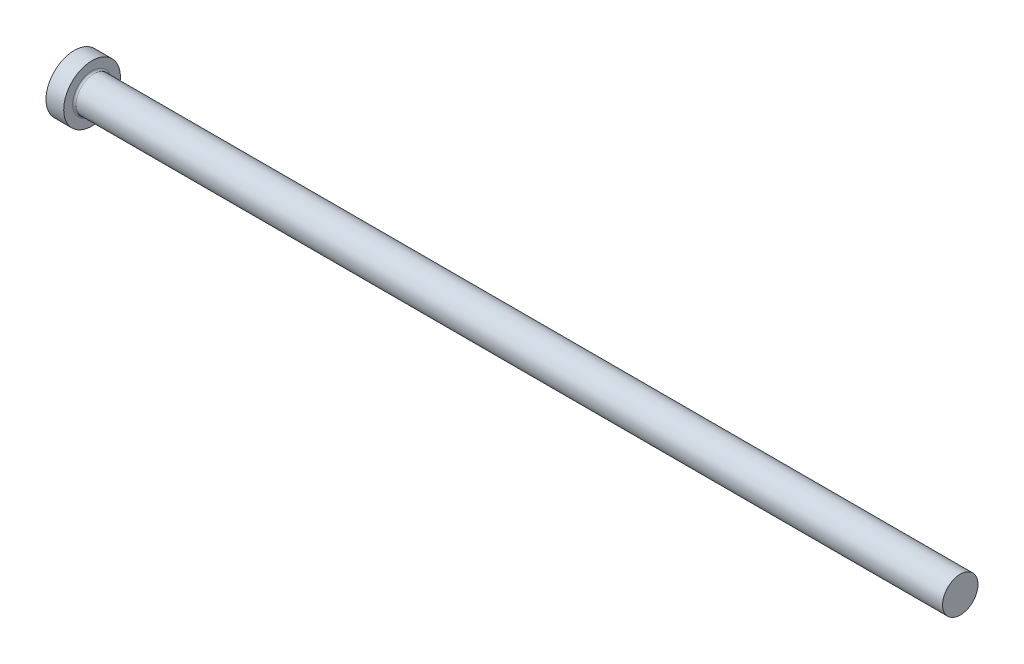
ISO-10303-21;
HEADER;
FILE_DESCRIPTION(('STEP AP214'),'2;1');
FILE_NAME('part.step','',(''),(''),'','','');
FILE_SCHEMA(('AUTOMOTIVE_DESIGN { 1 0 10303 214 1 1 1 1 }'));
ENDSEC;
DATA;
#1=APPLICATION_CONTEXT('core data for automotive mechanical design processes');
#2=APPLICATION_PROTOCOL_DEFINITION('international standard','automotive_design',2000,#1);
#3=PRODUCT_CONTEXT('',#1,'mechanical');
#4=PRODUCT('Part','Part','',(#3));
#5=PRODUCT_RELATED_PRODUCT_CATEGORY('part','',(#4));
#6=PRODUCT_DEFINITION_FORMATION('','',#4);
#7=PRODUCT_DEFINITION_CONTEXT('part definition',#1,'design');
#8=PRODUCT_DEFINITION('design','',#6,#7);
#9=PRODUCT_DEFINITION_SHAPE('','',#8);
#10=(LENGTH_UNIT() NAMED_UNIT(*) SI_UNIT(.MILLI.,.METRE.));
#11=(NAMED_UNIT(*) PLANE_ANGLE_UNIT() SI_UNIT($,.RADIAN.));
#12=(NAMED_UNIT(*) SI_UNIT($,.STERADIAN.) SOLID_ANGLE_UNIT());
#13=UNCERTAINTY_MEASURE_WITH_UNIT(LENGTH_MEASURE(1.E-05),#10,'distance_accuracy_value','');
#14=(GEOMETRIC_REPRESENTATION_CONTEXT(3) GLOBAL_UNCERTAINTY_ASSIGNED_CONTEXT((#13)) GLOBAL_UNIT_ASSIGNED_CONTEXT((#10,
#11,#12)) REPRESENTATION_CONTEXT('',''));
#15=CARTESIAN_POINT('',(0.,0.,0.));
#16=DIRECTION('',(0.,0.,1.));
#17=DIRECTION('',(1.,0.,0.));
#18=AXIS2_PLACEMENT_3D('',#15,#16,#17);
#19=CARTESIAN_POINT('',(0.,0.,0.));
#20=DIRECTION('',(-1.,0.,0.));
#21=DIRECTION('',(0.,-1.,0.));
#22=AXIS2_PLACEMENT_3D('',#19,#20,#21);
#23=PLANE('',#22);
#24=CARTESIAN_POINT('',(0.,0.,0.));
#25=DIRECTION('',(1.,0.,0.));
#26=DIRECTION('',(0.,1.,0.));
#27=AXIS2_PLACEMENT_3D('',#24,#25,#26);
#28=CIRCLE('',#27,8.);
#29=CARTESIAN_POINT('',(0.,8.,0.));
#30=VERTEX_POINT('',#29);
#31=EDGE_CURVE('E25',#30,#30,#28,.T.);
#32=ORIENTED_EDGE('',*,*,#31,.F.);
#33=EDGE_LOOP('',(#32));
#34=FACE_BOUND('',#33,.T.);
#35=ADVANCED_FACE('F14',(#34),#23,.T.);
#36=CARTESIAN_POINT('',(250.,0.,0.));
#37=DIRECTION('',(1.,0.,0.));
#38=DIRECTION('',(0.,1.,0.));
#39=AXIS2_PLACEMENT_3D('',#36,#37,#38);
#40=CYLINDRICAL_SURFACE('',#39,8.);
#41=ORIENTED_EDGE('',*,*,#31,.T.);
#42=EDGE_LOOP('',(#41));
#43=FACE_BOUND('',#42,.T.);
#44=CARTESIAN_POINT('',(5.,0.,0.));
#45=DIRECTION('',(1.,0.,0.));
#46=DIRECTION('',(0.,1.,0.));
#47=AXIS2_PLACEMENT_3D('',#44,#45,#46);
#48=CIRCLE('',#47,8.);
#49=CARTESIAN_POINT('',(5.,8.,0.));
#50=VERTEX_POINT('',#49);
#51=EDGE_CURVE('E29',#50,#50,#48,.T.);
#52=ORIENTED_EDGE('',*,*,#51,.F.);
#53=EDGE_LOOP('',(#52));
#54=FACE_BOUND('',#53,.T.);
#55=ADVANCED_FACE('F51',(#43,#54),#40,.T.);
#56=CARTESIAN_POINT('',(5.,8.,0.));
#57=DIRECTION('',(1.,0.,0.));
#58=DIRECTION('',(0.,1.,0.));
#59=AXIS2_PLACEMENT_3D('',#56,#57,#58);
#60=PLANE('',#59);
#61=CARTESIAN_POINT('',(5.,0.,0.));
#62=DIRECTION('',(1.,0.,0.));
#63=DIRECTION('',(0.,1.,0.));
#64=AXIS2_PLACEMENT_3D('',#61,#62,#63);
#65=CIRCLE('',#64,5.49999999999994);
#66=CARTESIAN_POINT('',(5.,5.49999999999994,0.));
#67=VERTEX_POINT('',#66);
#68=EDGE_CURVE('E9',#67,#67,#65,.F.);
#69=ORIENTED_EDGE('',*,*,#68,.T.);
#70=EDGE_LOOP('',(#69));
#71=FACE_BOUND('',#70,.T.);
#72=ORIENTED_EDGE('',*,*,#51,.T.);
#73=EDGE_LOOP('',(#72));
#74=FACE_BOUND('',#73,.T.);
#75=ADVANCED_FACE('F42',(#71,#74),#60,.T.);
#76=CARTESIAN_POINT('',(250.,0.,0.));
#77=DIRECTION('',(1.,0.,0.));
#78=DIRECTION('',(0.,1.,0.));
#79=AXIS2_PLACEMENT_3D('',#76,#77,#78);
#80=CYLINDRICAL_SURFACE('',#79,4.99999999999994);
#81=CARTESIAN_POINT('',(5.5,0.,0.));
#82=DIRECTION('',(1.,0.,0.));
#83=DIRECTION('',(0.,1.,0.));
#84=AXIS2_PLACEMENT_3D('',#81,#82,#83);
#85=CIRCLE('',#84,4.99999999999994);
#86=CARTESIAN_POINT('',(5.5,4.99999999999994,0.));
#87=VERTEX_POINT('',#86);
#88=EDGE_CURVE('E21',#87,#87,#85,.T.);
#89=ORIENTED_EDGE('',*,*,#88,.T.);
#90=EDGE_LOOP('',(#89));
#91=FACE_BOUND('',#90,.T.);
#92=CARTESIAN_POINT('',(250.,0.,0.));
#93=DIRECTION('',(1.,0.,0.));
#94=DIRECTION('',(0.,1.,0.));
#95=AXIS2_PLACEMENT_3D('',#92,#93,#94);
#96=CIRCLE('',#95,5.);
#97=CARTESIAN_POINT('',(250.,5.00000000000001,0.));
#98=VERTEX_POINT('',#97);
#99=EDGE_CURVE('E34',#98,#98,#96,.T.);
#100=ORIENTED_EDGE('',*,*,#99,.F.);
#101=EDGE_LOOP('',(#100));
#102=FACE_BOUND('',#101,.T.);
#103=ADVANCED_FACE('F40',(#91,#102),#80,.T.);
#104=CARTESIAN_POINT('',(250.,5.,0.));
#105=DIRECTION('',(1.,0.,0.));
#106=DIRECTION('',(0.,1.,0.));
#107=AXIS2_PLACEMENT_3D('',#104,#105,#106);
#108=PLANE('',#107);
#109=ORIENTED_EDGE('',*,*,#99,.T.);
#110=EDGE_LOOP('',(#109));
#111=FACE_BOUND('',#110,.T.);
#112=ADVANCED_FACE('F38',(#111),#108,.T.);
#113=CARTESIAN_POINT('',(5.5,0.,0.));
#114=DIRECTION('',(1.,0.,0.));
#115=DIRECTION('',(0.,1.,0.));
#116=AXIS2_PLACEMENT_3D('',#113,#114,#115);
#117=TOROIDAL_SURFACE('',#116,5.49999999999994,0.5);
#118=ORIENTED_EDGE('',*,*,#68,.F.);
#119=EDGE_LOOP('',(#118));
#120=FACE_BOUND('',#119,.T.);
#121=ORIENTED_EDGE('',*,*,#88,.F.);
#122=EDGE_LOOP('',(#121));
#123=FACE_BOUND('',#122,.T.);
#124=ADVANCED_FACE('F16',(#120,#123),#117,.F.);
#125=CLOSED_SHELL('',(#35,#55,#75,#103,#112,#124));
#126=MANIFOLD_SOLID_BREP('B1',#125);
#127=ADVANCED_BREP_SHAPE_REPRESENTATION('',(#18,#126),#14);
#128=SHAPE_DEFINITION_REPRESENTATION(#9,#127);
ENDSEC;
END-ISO-10303-21;
